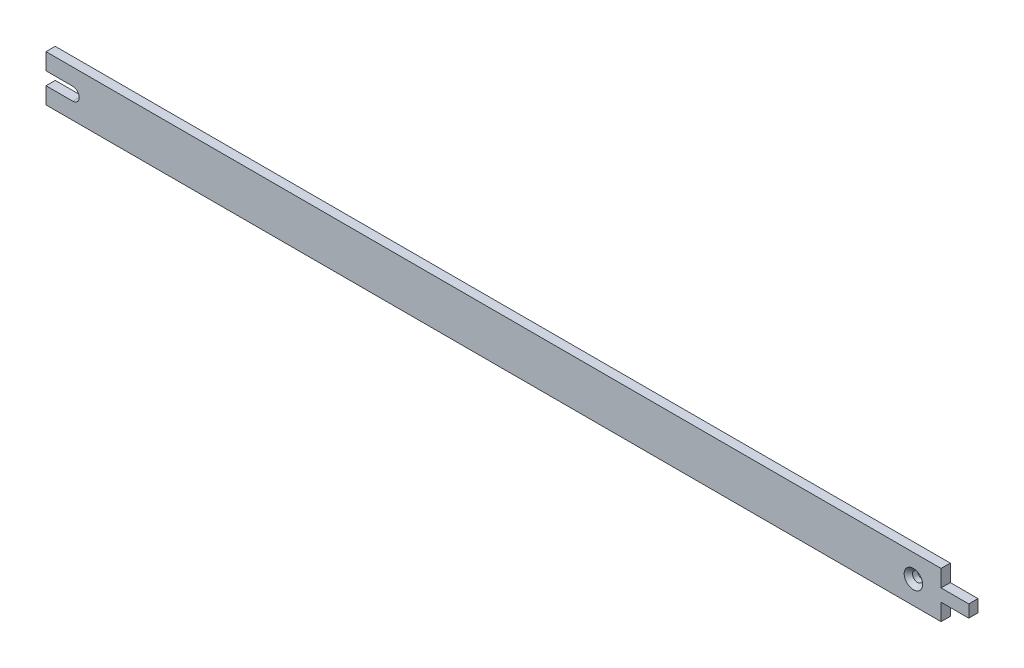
ISO-10303-21;
HEADER;
FILE_DESCRIPTION(('STEP AP214'),'2;1');
FILE_NAME('part.step','',(''),(''),'','','');
FILE_SCHEMA(('AUTOMOTIVE_DESIGN { 1 0 10303 214 1 1 1 1 }'));
ENDSEC;
DATA;
#1=APPLICATION_CONTEXT('core data for automotive mechanical design processes');
#2=APPLICATION_PROTOCOL_DEFINITION('international standard','automotive_design',2000,#1);
#3=PRODUCT_CONTEXT('',#1,'mechanical');
#4=PRODUCT('Part','Part','',(#3));
#5=PRODUCT_RELATED_PRODUCT_CATEGORY('part','',(#4));
#6=PRODUCT_DEFINITION_FORMATION('','',#4);
#7=PRODUCT_DEFINITION_CONTEXT('part definition',#1,'design');
#8=PRODUCT_DEFINITION('design','',#6,#7);
#9=PRODUCT_DEFINITION_SHAPE('','',#8);
#10=(LENGTH_UNIT() NAMED_UNIT(*) SI_UNIT(.MILLI.,.METRE.));
#11=(NAMED_UNIT(*) PLANE_ANGLE_UNIT() SI_UNIT($,.RADIAN.));
#12=(NAMED_UNIT(*) SI_UNIT($,.STERADIAN.) SOLID_ANGLE_UNIT());
#13=UNCERTAINTY_MEASURE_WITH_UNIT(LENGTH_MEASURE(1.E-05),#10,'distance_accuracy_value','');
#14=(GEOMETRIC_REPRESENTATION_CONTEXT(3) GLOBAL_UNCERTAINTY_ASSIGNED_CONTEXT((#13)) GLOBAL_UNIT_ASSIGNED_CONTEXT((#10,
#11,#12)) REPRESENTATION_CONTEXT('',''));
#15=CARTESIAN_POINT('',(0.,0.,0.));
#16=DIRECTION('',(0.,0.,1.));
#17=DIRECTION('',(1.,0.,0.));
#18=AXIS2_PLACEMENT_3D('',#15,#16,#17);
#19=CARTESIAN_POINT('',(15.,12.5,5.));
#20=DIRECTION('',(0.,0.,1.));
#21=DIRECTION('',(0.,1.,0.));
#22=AXIS2_PLACEMENT_3D('',#19,#20,#21);
#23=PLANE('',#22);
#24=DIRECTION('',(0.,1.,0.));
#25=VECTOR('',#24,1.);
#26=CARTESIAN_POINT('',(-470.,-17.5300371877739,5.));
#27=LINE('',#26,#25);
#28=CARTESIAN_POINT('',(-470.,-12.5,5.));
#29=VERTEX_POINT('',#28);
#30=CARTESIAN_POINT('',(-470.,-3.5,5.));
#31=VERTEX_POINT('',#30);
#32=EDGE_CURVE('E105',#29,#31,#27,.T.);
#33=ORIENTED_EDGE('',*,*,#32,.F.);
#34=DIRECTION('',(1.,0.,0.));
#35=VECTOR('',#34,1.);
#36=CARTESIAN_POINT('',(15.,-12.5,5.));
#37=LINE('',#36,#35);
#38=CARTESIAN_POINT('',(15.,-12.5,5.));
#39=VERTEX_POINT('',#38);
#40=EDGE_CURVE('E116',#29,#39,#37,.T.);
#41=ORIENTED_EDGE('',*,*,#40,.T.);
#42=DIRECTION('',(0.,1.,0.));
#43=VECTOR('',#42,1.);
#44=CARTESIAN_POINT('',(15.,-3.35,5.));
#45=LINE('',#44,#43);
#46=CARTESIAN_POINT('',(15.,-3.35,5.));
#47=VERTEX_POINT('',#46);
#48=EDGE_CURVE('E128',#39,#47,#45,.T.);
#49=ORIENTED_EDGE('',*,*,#48,.T.);
#50=DIRECTION('',(1.,0.,0.));
#51=VECTOR('',#50,1.);
#52=CARTESIAN_POINT('',(30.,-3.35,5.));
#53=LINE('',#52,#51);
#54=CARTESIAN_POINT('',(30.,-3.35,5.));
#55=VERTEX_POINT('',#54);
#56=EDGE_CURVE('E131',#47,#55,#53,.T.);
#57=ORIENTED_EDGE('',*,*,#56,.T.);
#58=DIRECTION('',(0.,1.,0.));
#59=VECTOR('',#58,1.);
#60=CARTESIAN_POINT('',(30.,-3.35,5.));
#61=LINE('',#60,#59);
#62=CARTESIAN_POINT('',(30.,3.35,5.));
#63=VERTEX_POINT('',#62);
#64=EDGE_CURVE('E34',#55,#63,#61,.T.);
#65=ORIENTED_EDGE('',*,*,#64,.T.);
#66=DIRECTION('',(-1.,0.,0.));
#67=VECTOR('',#66,1.);
#68=CARTESIAN_POINT('',(30.,3.35,5.));
#69=LINE('',#68,#67);
#70=CARTESIAN_POINT('',(15.,3.35,5.));
#71=VERTEX_POINT('',#70);
#72=EDGE_CURVE('E29',#63,#71,#69,.T.);
#73=ORIENTED_EDGE('',*,*,#72,.T.);
#74=DIRECTION('',(0.,1.,0.));
#75=VECTOR('',#74,1.);
#76=CARTESIAN_POINT('',(15.,3.35,5.));
#77=LINE('',#76,#75);
#78=CARTESIAN_POINT('',(15.,12.5,5.));
#79=VERTEX_POINT('',#78);
#80=EDGE_CURVE('E134',#71,#79,#77,.T.);
#81=ORIENTED_EDGE('',*,*,#80,.T.);
#82=DIRECTION('',(-1.,0.,0.));
#83=VECTOR('',#82,1.);
#84=CARTESIAN_POINT('',(15.,12.5,5.));
#85=LINE('',#84,#83);
#86=CARTESIAN_POINT('',(-470.,12.5,5.));
#87=VERTEX_POINT('',#86);
#88=EDGE_CURVE('E129',#79,#87,#85,.T.);
#89=ORIENTED_EDGE('',*,*,#88,.T.);
#90=CARTESIAN_POINT('',(-470.,3.5,5.));
#91=VERTEX_POINT('',#90);
#92=EDGE_CURVE('E122',#91,#87,#27,.T.);
#93=ORIENTED_EDGE('',*,*,#92,.F.);
#94=DIRECTION('',(-1.,0.,0.));
#95=VECTOR('',#94,1.);
#96=CARTESIAN_POINT('',(-455.5,3.5,5.));
#97=LINE('',#96,#95);
#98=CARTESIAN_POINT('',(-455.5,3.5,5.));
#99=VERTEX_POINT('',#98);
#100=EDGE_CURVE('E267',#99,#91,#97,.T.);
#101=ORIENTED_EDGE('',*,*,#100,.F.);
#102=CARTESIAN_POINT('',(-455.5,0.,5.));
#103=DIRECTION('',(0.,0.,1.));
#104=DIRECTION('',(-1.,0.,0.));
#105=AXIS2_PLACEMENT_3D('',#102,#103,#104);
#106=CIRCLE('',#105,3.5);
#107=CARTESIAN_POINT('',(-455.5,-3.5,5.));
#108=VERTEX_POINT('',#107);
#109=EDGE_CURVE('E264',#108,#99,#106,.T.);
#110=ORIENTED_EDGE('',*,*,#109,.F.);
#111=DIRECTION('',(1.,0.,0.));
#112=VECTOR('',#111,1.);
#113=CARTESIAN_POINT('',(-470.,-3.5,5.));
#114=LINE('',#113,#112);
#115=EDGE_CURVE('E120',#31,#108,#114,.T.);
#116=ORIENTED_EDGE('',*,*,#115,.F.);
#117=EDGE_LOOP('',(#33,#41,#49,#57,#65,#73,#81,#89,#93,#101,#110,#116));
#118=FACE_BOUND('',#117,.T.);
#119=CARTESIAN_POINT('',(0.,0.,5.));
#120=DIRECTION('',(0.,0.,1.));
#121=DIRECTION('',(0.,1.,0.));
#122=AXIS2_PLACEMENT_3D('',#119,#120,#121);
#123=CIRCLE('',#122,5.);
#124=CARTESIAN_POINT('',(0.,5.,5.));
#125=VERTEX_POINT('',#124);
#126=EDGE_CURVE('E9',#125,#125,#123,.F.);
#127=ORIENTED_EDGE('',*,*,#126,.T.);
#128=EDGE_LOOP('',(#127));
#129=FACE_BOUND('',#128,.T.);
#130=ADVANCED_FACE('F14',(#118,#129),#23,.T.);
#131=CARTESIAN_POINT('',(15.,12.5,0.));
#132=DIRECTION('',(0.,0.,1.));
#133=DIRECTION('',(0.,1.,0.));
#134=AXIS2_PLACEMENT_3D('',#131,#132,#133);
#135=PLANE('',#134);
#136=DIRECTION('',(1.,0.,0.));
#137=VECTOR('',#136,1.);
#138=CARTESIAN_POINT('',(15.,-12.5,0.));
#139=LINE('',#138,#137);
#140=CARTESIAN_POINT('',(-470.,-12.5,0.));
#141=VERTEX_POINT('',#140);
#142=CARTESIAN_POINT('',(15.,-12.5,0.));
#143=VERTEX_POINT('',#142);
#144=EDGE_CURVE('E220',#141,#143,#139,.T.);
#145=ORIENTED_EDGE('',*,*,#144,.F.);
#146=DIRECTION('',(0.,1.,0.));
#147=VECTOR('',#146,1.);
#148=CARTESIAN_POINT('',(-470.,-17.5300371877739,0.));
#149=LINE('',#148,#147);
#150=CARTESIAN_POINT('',(-470.,-3.5,0.));
#151=VERTEX_POINT('',#150);
#152=EDGE_CURVE('E108',#141,#151,#149,.T.);
#153=ORIENTED_EDGE('',*,*,#152,.T.);
#154=DIRECTION('',(1.,0.,0.));
#155=VECTOR('',#154,1.);
#156=CARTESIAN_POINT('',(-470.,-3.5,0.));
#157=LINE('',#156,#155);
#158=CARTESIAN_POINT('',(-455.5,-3.5,0.));
#159=VERTEX_POINT('',#158);
#160=EDGE_CURVE('E248',#151,#159,#157,.T.);
#161=ORIENTED_EDGE('',*,*,#160,.T.);
#162=CARTESIAN_POINT('',(-455.5,0.,0.));
#163=DIRECTION('',(0.,0.,1.));
#164=DIRECTION('',(-1.,0.,0.));
#165=AXIS2_PLACEMENT_3D('',#162,#163,#164);
#166=CIRCLE('',#165,3.5);
#167=CARTESIAN_POINT('',(-455.5,3.5,0.));
#168=VERTEX_POINT('',#167);
#169=EDGE_CURVE('E260',#159,#168,#166,.T.);
#170=ORIENTED_EDGE('',*,*,#169,.T.);
#171=DIRECTION('',(-1.,0.,0.));
#172=VECTOR('',#171,1.);
#173=CARTESIAN_POINT('',(-455.5,3.5,0.));
#174=LINE('',#173,#172);
#175=CARTESIAN_POINT('',(-470.,3.5,0.));
#176=VERTEX_POINT('',#175);
#177=EDGE_CURVE('E255',#168,#176,#174,.T.);
#178=ORIENTED_EDGE('',*,*,#177,.T.);
#179=CARTESIAN_POINT('',(-470.,12.5,0.));
#180=VERTEX_POINT('',#179);
#181=EDGE_CURVE('E121',#176,#180,#149,.T.);
#182=ORIENTED_EDGE('',*,*,#181,.T.);
#183=DIRECTION('',(-1.,0.,0.));
#184=VECTOR('',#183,1.);
#185=CARTESIAN_POINT('',(15.,12.5,0.));
#186=LINE('',#185,#184);
#187=CARTESIAN_POINT('',(15.,12.5,0.));
#188=VERTEX_POINT('',#187);
#189=EDGE_CURVE('E215',#188,#180,#186,.T.);
#190=ORIENTED_EDGE('',*,*,#189,.F.);
#191=DIRECTION('',(0.,1.,0.));
#192=VECTOR('',#191,1.);
#193=CARTESIAN_POINT('',(15.,3.35,0.));
#194=LINE('',#193,#192);
#195=CARTESIAN_POINT('',(15.,3.35,0.));
#196=VERTEX_POINT('',#195);
#197=EDGE_CURVE('E221',#196,#188,#194,.T.);
#198=ORIENTED_EDGE('',*,*,#197,.F.);
#199=DIRECTION('',(-1.,0.,0.));
#200=VECTOR('',#199,1.);
#201=CARTESIAN_POINT('',(30.,3.35,0.));
#202=LINE('',#201,#200);
#203=CARTESIAN_POINT('',(30.,3.35,0.));
#204=VERTEX_POINT('',#203);
#205=EDGE_CURVE('E234',#204,#196,#202,.T.);
#206=ORIENTED_EDGE('',*,*,#205,.F.);
#207=DIRECTION('',(0.,1.,0.));
#208=VECTOR('',#207,1.);
#209=CARTESIAN_POINT('',(30.,-3.35,0.));
#210=LINE('',#209,#208);
#211=CARTESIAN_POINT('',(30.,-3.35,0.));
#212=VERTEX_POINT('',#211);
#213=EDGE_CURVE('E232',#212,#204,#210,.T.);
#214=ORIENTED_EDGE('',*,*,#213,.F.);
#215=DIRECTION('',(1.,0.,0.));
#216=VECTOR('',#215,1.);
#217=CARTESIAN_POINT('',(30.,-3.35,0.));
#218=LINE('',#217,#216);
#219=CARTESIAN_POINT('',(15.,-3.35,0.));
#220=VERTEX_POINT('',#219);
#221=EDGE_CURVE('E230',#220,#212,#218,.T.);
#222=ORIENTED_EDGE('',*,*,#221,.F.);
#223=DIRECTION('',(0.,1.,0.));
#224=VECTOR('',#223,1.);
#225=CARTESIAN_POINT('',(15.,-3.35,0.));
#226=LINE('',#225,#224);
#227=EDGE_CURVE('E223',#143,#220,#226,.T.);
#228=ORIENTED_EDGE('',*,*,#227,.F.);
#229=EDGE_LOOP('',(#145,#153,#161,#170,#178,#182,#190,#198,#206,#214,#222,#228));
#230=FACE_BOUND('',#229,.T.);
#231=CARTESIAN_POINT('',(0.,0.,0.));
#232=DIRECTION('',(0.,0.,1.));
#233=DIRECTION('',(0.,1.,0.));
#234=AXIS2_PLACEMENT_3D('',#231,#232,#233);
#235=CIRCLE('',#234,2.75);
#236=CARTESIAN_POINT('',(0.,2.75,0.));
#237=VERTEX_POINT('',#236);
#238=EDGE_CURVE('E225',#237,#237,#235,.T.);
#239=ORIENTED_EDGE('',*,*,#238,.T.);
#240=EDGE_LOOP('',(#239));
#241=FACE_BOUND('',#240,.T.);
#242=ADVANCED_FACE('F180',(#230,#241),#135,.F.);
#243=CARTESIAN_POINT('',(15.,3.35,5.));
#244=DIRECTION('',(-1.,0.,0.));
#245=DIRECTION('',(0.,-1.,0.));
#246=AXIS2_PLACEMENT_3D('',#243,#244,#245);
#247=PLANE('',#246);
#248=ORIENTED_EDGE('',*,*,#197,.T.);
#249=DIRECTION('',(0.,0.,-1.));
#250=VECTOR('',#249,1.);
#251=CARTESIAN_POINT('',(15.,12.5,5.));
#252=LINE('',#251,#250);
#253=EDGE_CURVE('E154',#79,#188,#252,.T.);
#254=ORIENTED_EDGE('',*,*,#253,.F.);
#255=ORIENTED_EDGE('',*,*,#80,.F.);
#256=DIRECTION('',(0.,0.,-1.));
#257=VECTOR('',#256,1.);
#258=CARTESIAN_POINT('',(15.,3.35,5.));
#259=LINE('',#258,#257);
#260=EDGE_CURVE('E141',#71,#196,#259,.T.);
#261=ORIENTED_EDGE('',*,*,#260,.T.);
#262=EDGE_LOOP('',(#248,#254,#255,#261));
#263=FACE_BOUND('',#262,.T.);
#264=ADVANCED_FACE('F16',(#263),#247,.F.);
#265=CARTESIAN_POINT('',(15.,12.5,5.));
#266=DIRECTION('',(0.,-1.,0.));
#267=DIRECTION('',(1.,0.,0.));
#268=AXIS2_PLACEMENT_3D('',#265,#266,#267);
#269=PLANE('',#268);
#270=ORIENTED_EDGE('',*,*,#189,.T.);
#271=DIRECTION('',(0.,0.,1.));
#272=VECTOR('',#271,1.);
#273=CARTESIAN_POINT('',(-470.,12.5,5.));
#274=LINE('',#273,#272);
#275=EDGE_CURVE('E112',#180,#87,#274,.T.);
#276=ORIENTED_EDGE('',*,*,#275,.T.);
#277=ORIENTED_EDGE('',*,*,#88,.F.);
#278=ORIENTED_EDGE('',*,*,#253,.T.);
#279=EDGE_LOOP('',(#270,#276,#277,#278));
#280=FACE_BOUND('',#279,.T.);
#281=ADVANCED_FACE('F205',(#280),#269,.F.);
#282=CARTESIAN_POINT('',(15.,-12.5,5.));
#283=DIRECTION('',(0.,1.,0.));
#284=DIRECTION('',(-1.,0.,0.));
#285=AXIS2_PLACEMENT_3D('',#282,#283,#284);
#286=PLANE('',#285);
#287=ORIENTED_EDGE('',*,*,#40,.F.);
#288=DIRECTION('',(0.,0.,-1.));
#289=VECTOR('',#288,1.);
#290=CARTESIAN_POINT('',(-470.,-12.5,5.));
#291=LINE('',#290,#289);
#292=EDGE_CURVE('E102',#29,#141,#291,.T.);
#293=ORIENTED_EDGE('',*,*,#292,.T.);
#294=ORIENTED_EDGE('',*,*,#144,.T.);
#295=DIRECTION('',(0.,0.,-1.));
#296=VECTOR('',#295,1.);
#297=CARTESIAN_POINT('',(15.,-12.5,5.));
#298=LINE('',#297,#296);
#299=EDGE_CURVE('E126',#39,#143,#298,.T.);
#300=ORIENTED_EDGE('',*,*,#299,.F.);
#301=EDGE_LOOP('',(#287,#293,#294,#300));
#302=FACE_BOUND('',#301,.T.);
#303=ADVANCED_FACE('F124',(#302),#286,.F.);
#304=CARTESIAN_POINT('',(15.,-3.35,5.));
#305=DIRECTION('',(-1.,0.,0.));
#306=DIRECTION('',(0.,-1.,0.));
#307=AXIS2_PLACEMENT_3D('',#304,#305,#306);
#308=PLANE('',#307);
#309=ORIENTED_EDGE('',*,*,#227,.T.);
#310=DIRECTION('',(0.,0.,-1.));
#311=VECTOR('',#310,1.);
#312=CARTESIAN_POINT('',(15.,-3.35,5.));
#313=LINE('',#312,#311);
#314=EDGE_CURVE('E150',#47,#220,#313,.T.);
#315=ORIENTED_EDGE('',*,*,#314,.F.);
#316=ORIENTED_EDGE('',*,*,#48,.F.);
#317=ORIENTED_EDGE('',*,*,#299,.T.);
#318=EDGE_LOOP('',(#309,#315,#316,#317));
#319=FACE_BOUND('',#318,.T.);
#320=ADVANCED_FACE('F199',(#319),#308,.F.);
#321=CARTESIAN_POINT('',(30.,-3.35,5.));
#322=DIRECTION('',(0.,1.,0.));
#323=DIRECTION('',(-1.,0.,0.));
#324=AXIS2_PLACEMENT_3D('',#321,#322,#323);
#325=PLANE('',#324);
#326=ORIENTED_EDGE('',*,*,#221,.T.);
#327=DIRECTION('',(0.,0.,-1.));
#328=VECTOR('',#327,1.);
#329=CARTESIAN_POINT('',(30.,-3.35,5.));
#330=LINE('',#329,#328);
#331=EDGE_CURVE('E147',#55,#212,#330,.T.);
#332=ORIENTED_EDGE('',*,*,#331,.F.);
#333=ORIENTED_EDGE('',*,*,#56,.F.);
#334=ORIENTED_EDGE('',*,*,#314,.T.);
#335=EDGE_LOOP('',(#326,#332,#333,#334));
#336=FACE_BOUND('',#335,.T.);
#337=ADVANCED_FACE('F195',(#336),#325,.F.);
#338=CARTESIAN_POINT('',(30.,-3.35,5.));
#339=DIRECTION('',(-1.,0.,0.));
#340=DIRECTION('',(0.,-1.,0.));
#341=AXIS2_PLACEMENT_3D('',#338,#339,#340);
#342=PLANE('',#341);
#343=ORIENTED_EDGE('',*,*,#213,.T.);
#344=DIRECTION('',(0.,0.,-1.));
#345=VECTOR('',#344,1.);
#346=CARTESIAN_POINT('',(30.,3.35,5.));
#347=LINE('',#346,#345);
#348=EDGE_CURVE('E144',#63,#204,#347,.T.);
#349=ORIENTED_EDGE('',*,*,#348,.F.);
#350=ORIENTED_EDGE('',*,*,#64,.F.);
#351=ORIENTED_EDGE('',*,*,#331,.T.);
#352=EDGE_LOOP('',(#343,#349,#350,#351));
#353=FACE_BOUND('',#352,.T.);
#354=ADVANCED_FACE('F191',(#353),#342,.F.);
#355=CARTESIAN_POINT('',(30.,3.35,5.));
#356=DIRECTION('',(0.,-1.,0.));
#357=DIRECTION('',(1.,0.,0.));
#358=AXIS2_PLACEMENT_3D('',#355,#356,#357);
#359=PLANE('',#358);
#360=ORIENTED_EDGE('',*,*,#205,.T.);
#361=ORIENTED_EDGE('',*,*,#260,.F.);
#362=ORIENTED_EDGE('',*,*,#72,.F.);
#363=ORIENTED_EDGE('',*,*,#348,.T.);
#364=EDGE_LOOP('',(#360,#361,#362,#363));
#365=FACE_BOUND('',#364,.T.);
#366=ADVANCED_FACE('F176',(#365),#359,.F.);
#367=CARTESIAN_POINT('',(0.,0.,5.));
#368=DIRECTION('',(0.,0.,-1.));
#369=DIRECTION('',(0.,-1.,0.));
#370=AXIS2_PLACEMENT_3D('',#367,#368,#369);
#371=CYLINDRICAL_SURFACE('',#370,2.75);
#372=CARTESIAN_POINT('',(0.,0.,2.75));
#373=DIRECTION('',(0.,0.,1.));
#374=DIRECTION('',(0.,1.,0.));
#375=AXIS2_PLACEMENT_3D('',#372,#373,#374);
#376=CIRCLE('',#375,2.75);
#377=CARTESIAN_POINT('',(0.,2.75,2.75));
#378=VERTEX_POINT('',#377);
#379=EDGE_CURVE('E22',#378,#378,#376,.T.);
#380=ORIENTED_EDGE('',*,*,#379,.T.);
#381=EDGE_LOOP('',(#380));
#382=FACE_BOUND('',#381,.T.);
#383=ORIENTED_EDGE('',*,*,#238,.F.);
#384=EDGE_LOOP('',(#383));
#385=FACE_BOUND('',#384,.T.);
#386=ADVANCED_FACE('F159',(#382,#385),#371,.F.);
#387=CARTESIAN_POINT('',(0.,0.,2.75));
#388=DIRECTION('',(0.,0.,1.));
#389=DIRECTION('',(0.,1.,0.));
#390=AXIS2_PLACEMENT_3D('',#387,#388,#389);
#391=CONICAL_SURFACE('',#390,2.75,0.78539816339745);
#392=ORIENTED_EDGE('',*,*,#126,.F.);
#393=EDGE_LOOP('',(#392));
#394=FACE_BOUND('',#393,.T.);
#395=ORIENTED_EDGE('',*,*,#379,.F.);
#396=EDGE_LOOP('',(#395));
#397=FACE_BOUND('',#396,.T.);
#398=ADVANCED_FACE('F162',(#394,#397),#391,.F.);
#399=CARTESIAN_POINT('',(-455.5,0.,0.));
#400=DIRECTION('',(0.,0.,1.));
#401=DIRECTION('',(-1.,0.,0.));
#402=AXIS2_PLACEMENT_3D('',#399,#400,#401);
#403=CYLINDRICAL_SURFACE('',#402,3.5);
#404=ORIENTED_EDGE('',*,*,#109,.T.);
#405=DIRECTION('',(0.,0.,1.));
#406=VECTOR('',#405,1.);
#407=CARTESIAN_POINT('',(-455.5,3.5,0.));
#408=LINE('',#407,#406);
#409=EDGE_CURVE('E254',#168,#99,#408,.T.);
#410=ORIENTED_EDGE('',*,*,#409,.F.);
#411=ORIENTED_EDGE('',*,*,#169,.F.);
#412=DIRECTION('',(0.,0.,1.));
#413=VECTOR('',#412,1.);
#414=CARTESIAN_POINT('',(-455.5,-3.5,0.));
#415=LINE('',#414,#413);
#416=EDGE_CURVE('E252',#159,#108,#415,.T.);
#417=ORIENTED_EDGE('',*,*,#416,.T.);
#418=EDGE_LOOP('',(#404,#410,#411,#417));
#419=FACE_BOUND('',#418,.T.);
#420=ADVANCED_FACE('F164',(#419),#403,.F.);
#421=CARTESIAN_POINT('',(-470.,-3.5,0.));
#422=DIRECTION('',(0.,-1.,0.));
#423=DIRECTION('',(0.,0.,1.));
#424=AXIS2_PLACEMENT_3D('',#421,#422,#423);
#425=PLANE('',#424);
#426=ORIENTED_EDGE('',*,*,#115,.T.);
#427=ORIENTED_EDGE('',*,*,#416,.F.);
#428=ORIENTED_EDGE('',*,*,#160,.F.);
#429=DIRECTION('',(0.,0.,1.));
#430=VECTOR('',#429,1.);
#431=CARTESIAN_POINT('',(-470.,-3.5,0.));
#432=LINE('',#431,#430);
#433=EDGE_CURVE('E251',#151,#31,#432,.T.);
#434=ORIENTED_EDGE('',*,*,#433,.T.);
#435=EDGE_LOOP('',(#426,#427,#428,#434));
#436=FACE_BOUND('',#435,.T.);
#437=ADVANCED_FACE('F173',(#436),#425,.F.);
#438=CARTESIAN_POINT('',(-455.5,3.5,0.));
#439=DIRECTION('',(0.,1.,0.));
#440=DIRECTION('',(0.,0.,-1.));
#441=AXIS2_PLACEMENT_3D('',#438,#439,#440);
#442=PLANE('',#441);
#443=ORIENTED_EDGE('',*,*,#100,.T.);
#444=DIRECTION('',(0.,0.,1.));
#445=VECTOR('',#444,1.);
#446=CARTESIAN_POINT('',(-470.,3.5,0.));
#447=LINE('',#446,#445);
#448=EDGE_CURVE('E257',#176,#91,#447,.T.);
#449=ORIENTED_EDGE('',*,*,#448,.F.);
#450=ORIENTED_EDGE('',*,*,#177,.F.);
#451=ORIENTED_EDGE('',*,*,#409,.T.);
#452=EDGE_LOOP('',(#443,#449,#450,#451));
#453=FACE_BOUND('',#452,.T.);
#454=ADVANCED_FACE('F281',(#453),#442,.F.);
#455=CARTESIAN_POINT('',(-470.,-17.5300371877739,0.));
#456=DIRECTION('',(1.,0.,0.));
#457=DIRECTION('',(0.,0.,1.));
#458=AXIS2_PLACEMENT_3D('',#455,#456,#457);
#459=PLANE('',#458);
#460=ORIENTED_EDGE('',*,*,#181,.F.);
#461=ORIENTED_EDGE('',*,*,#448,.T.);
#462=ORIENTED_EDGE('',*,*,#92,.T.);
#463=ORIENTED_EDGE('',*,*,#275,.F.);
#464=EDGE_LOOP('',(#460,#461,#462,#463));
#465=FACE_BOUND('',#464,.T.);
#466=ADVANCED_FACE('F277',(#465),#459,.F.);
#467=ORIENTED_EDGE('',*,*,#32,.T.);
#468=ORIENTED_EDGE('',*,*,#433,.F.);
#469=ORIENTED_EDGE('',*,*,#152,.F.);
#470=ORIENTED_EDGE('',*,*,#292,.F.);
#471=EDGE_LOOP('',(#467,#468,#469,#470));
#472=FACE_BOUND('',#471,.T.);
#473=ADVANCED_FACE('F104',(#472),#459,.F.);
#474=CLOSED_SHELL('',(#130,#242,#264,#281,#303,#320,#337,#354,#366,#386,#398,#420,#437,#454,
#466,#473));
#475=MANIFOLD_SOLID_BREP('B1',#474);
#476=ADVANCED_BREP_SHAPE_REPRESENTATION('',(#18,#475),#14);
#477=SHAPE_DEFINITION_REPRESENTATION(#9,#476);
ENDSEC;
END-ISO-10303-21;
